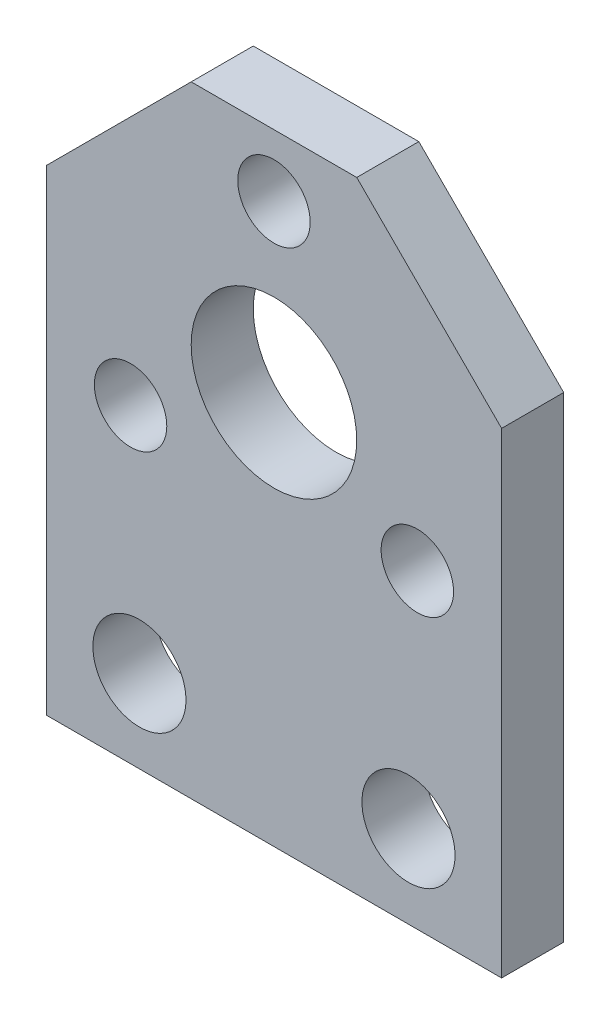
from build123d import *

# Parameters (mm, degrees)
ESQUISSE1_W        = 22
ESQUISSE1_H        = 30
ESQUISSE1_R        = 4
ESQUISSE1_R_2      = 1.75
ESQUISSE1_R_3      = 2.25
BOSS_EXTRU_1_DEPTH = 3
CHANFREIN1_SIZE    = 7


with BuildPart() as part:
    # Esquisse1 → Boss.-Extru.1 (new body)
    with BuildSketch(Plane.XY):
        with Locations((0, -4)):
            Rectangle(ESQUISSE1_W, ESQUISSE1_H)
        Circle(ESQUISSE1_R, mode=Mode.SUBTRACT)
        with Locations((0, 8)):
            Circle(ESQUISSE1_R_2, mode=Mode.SUBTRACT)
        with Locations((6.92820323, -4)):
            Circle(ESQUISSE1_R_2, mode=Mode.SUBTRACT)
        with Locations((-6.92820323, -4)):
            Circle(ESQUISSE1_R_2, mode=Mode.SUBTRACT)
        with Locations((-6.5, -15)):
            Circle(ESQUISSE1_R_3, mode=Mode.SUBTRACT)
        with Locations((6.5, -15)):
            Circle(ESQUISSE1_R_3, mode=Mode.SUBTRACT)
    extrude(amount=BOSS_EXTRU_1_DEPTH)

    # Chanfrein1
    chanfrein1_edges = [part.edges().sort_by_distance(p)[0] for p in [
        (-11, 11, 1.5),
        (11, 11, 1.5),
    ]]
    chamfer(chanfrein1_edges, length=CHANFREIN1_SIZE)


solid = part.part
